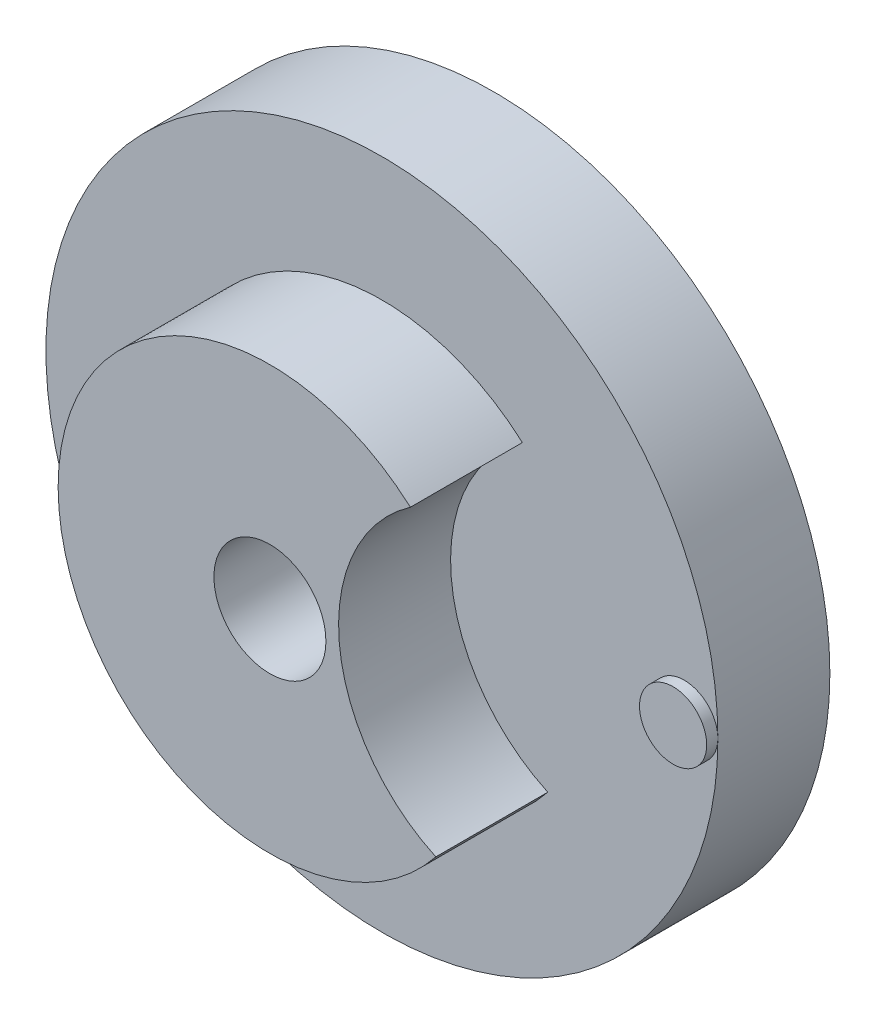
from build123d import *

# Parameters (mm, degrees)
ESQUISSE1_R             = 30
ESQUISSE1_R_2           = 5
EXTRUSION1_DEPTH        = 10
ESQUISSE5_R             = 18.91
EXTRUSION3_DEPTH        = 10
ENL_V_START             = -10
ESQUISSE6_R             = 5
ENL_V_MAT_EXTRU_1_DEPTH = 10
ENL_V_MAT_EXTRU_2_DEPTH = 10
ESQUISSE4_R             = 3
BOSS_EXTRU_1_DEPTH      = 1


with BuildPart() as part:
    # Esquisse1 → Extrusion1 (new body)
    with BuildSketch(Plane.XY):
        Circle(ESQUISSE1_R)
        Circle(ESQUISSE1_R_2, mode=Mode.SUBTRACT)
    extrude(amount=EXTRUSION1_DEPTH)

    # Esquisse5 → Extrusion3 (add)
    with BuildSketch(Plane.XY.offset(10)):
        Circle(ESQUISSE5_R)
    extrude(amount=EXTRUSION3_DEPTH)

    # Esquisse6 → Enl_v. mat.-Extru.1 (cut)
    with BuildSketch(Plane.XY.offset(20).offset(ENL_V_START)):
        Circle(ESQUISSE6_R)
    extrude(amount=ENL_V_MAT_EXTRU_1_DEPTH, mode=Mode.SUBTRACT)

    # Esquisse7 → Enl_v. mat.-Extru.2 (cut)
    with BuildSketch(Plane.XY.offset(20).offset(ENL_V_START)):
        with BuildLine():
            ThreePointArc((12.546362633, 14.14838806), (6.189560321, 0.54151636), (14.812596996, -11.754789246))
            ThreePointArc((14.812596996, -11.754789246), (18.838041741, 1.648115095), (12.546362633, 14.14838806))
        make_face()
    extrude(amount=ENL_V_MAT_EXTRU_2_DEPTH, mode=Mode.SUBTRACT)

    # Esquisse4 → Boss.-Extru.1 (add)
    with BuildSketch(Plane.XY.offset(10)):
        with Locations((27, 0)):
            Circle(ESQUISSE4_R)
    extrude(amount=BOSS_EXTRU_1_DEPTH)


solid = part.part
